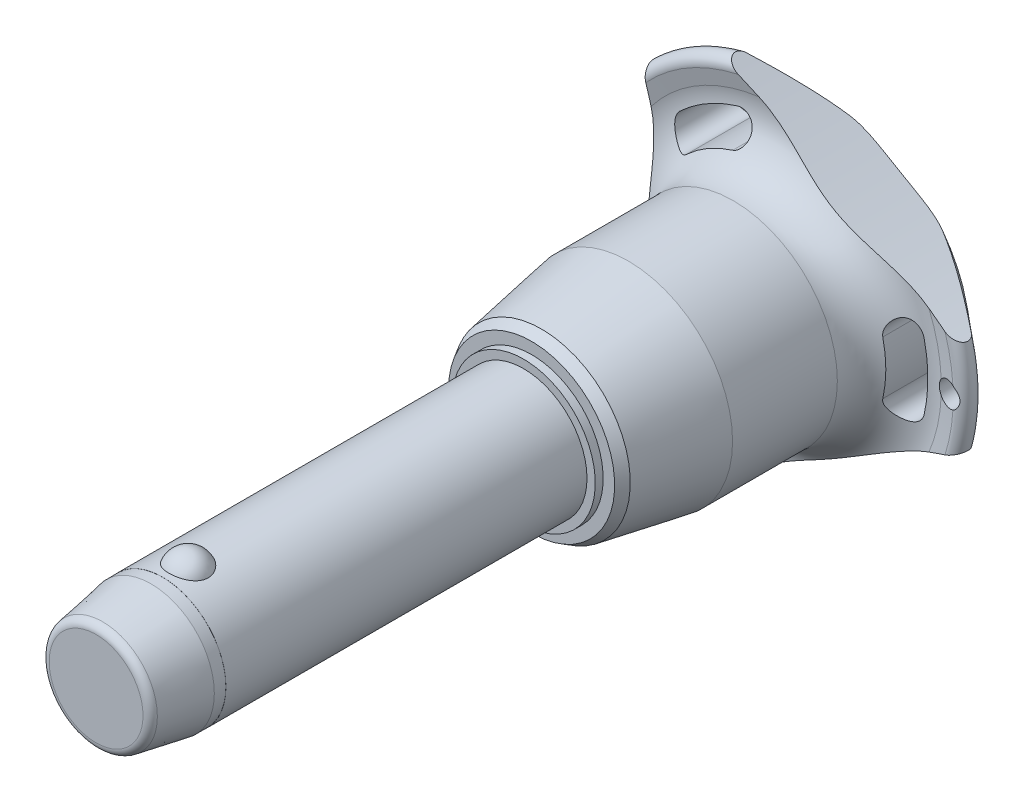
from build123d import *

# Parameters (mm, degrees)
SKETCH1_R           = 8
BOSS_EXTRUDE1_DEPTH = 40
SKETCH2_R           = 7
BOSS_EXTRUDE2_DEPTH = 39.7
BOSS_EXTRUDE3_START = 14
SKETCH1_2_R         = 8
BOSS_EXTRUDE3_DEPTH = 14
CHAMFER1_SIZE       = 7
CHAMFER1_SIZE2      = 1.234288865
FILLET1_R           = 1
SKETCH6_R           = 144.275
CUT_EXTRUDE1_DEPTH  = 87.518467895
CIRPATTERN1_COUNT   = 3
SKETCH7_R           = 1.5
CUT_EXTRUDE2_DEPTH  = 87.286194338
SKETCH8_R           = 8
SKETCH8_R_2         = 7.99
CUT_EXTRUDE3_DEPTH  = 8.4


with BuildPart() as part:
    # Sketch1 → Boss-Extrude1 (new body)
    with BuildSketch(Plane.XY):
        Circle(SKETCH1_R)
    extrude(amount=-BOSS_EXTRUDE1_DEPTH)

    # Sketch2 → Boss-Extrude2 (add)
    with BuildSketch(Plane(origin=(0, 0, -40), x_dir=(-1, 0, 0), z_dir=(0, 0, -1))):
        Circle(SKETCH2_R)
    extrude(amount=BOSS_EXTRUDE2_DEPTH)

    # Sketch3 → Revolve1 (revolve)
    with BuildSketch(Plane(origin=(0, 0, 0), x_dir=(0, 0, -1), z_dir=(1, 0, 0))):
        with BuildLine():
            Line((-2.387467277, 9.5), (-2.387467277, 4.2))
            ThreePointArc((-2.387467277, 4.2), (0.262532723, 6.85), (-2.387467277, 9.5))
        make_face()
        with BuildLine():
            Line((-2.387467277, -4.2), (-2.387467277, -9.5))
            ThreePointArc((-2.387467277, -9.5), (0.262532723, -6.85), (-2.387467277, -4.2))
        make_face()
    revolve(axis=Axis((0, -4.2, 2.387467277), (0, 1, 0)))

    # Sketch1_2 → Boss-Extrude3 (add)
    with BuildSketch(Plane.XY.offset(BOSS_EXTRUDE3_START)):
        Circle(SKETCH1_2_R)
    extrude(amount=-BOSS_EXTRUDE3_DEPTH)

    # Chamfer1
    chamfer1_edges = [part.edges().sort_by_distance(p)[0] for p in [
        (-8, 0, 14),
    ]]
    chamfer1_side = [part.faces().sort_by_distance(p)[0] for p in [
        (-8, 0, -13),
    ]]
    chamfer(chamfer1_edges, length=CHAMFER1_SIZE, length2=CHAMFER1_SIZE2, reference=chamfer1_side[0])

    # Fillet1
    fillet1_edges = [part.edges().sort_by_distance(p)[0] for p in [
        (-6.765711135, 0, 14),
        (7, 0, -79.7),
    ]]
    fillet(fillet1_edges, radius=FILLET1_R)

    # Sketch4 → Revolve2 (revolve)
    with BuildSketch(Plane(origin=(0, 0, 0), x_dir=(0, 0, -1), z_dir=(1, 0, 0)), mode=Mode.PRIVATE) as revolve2_sk:
        Polygon((40, 0), (40, 9.044607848), (41, 9.044607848), (41, 10.490707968), (42.25235944, 11.213758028), (53.233333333, 13.15), (66.466666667, 13.15), (66.466666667, 0), align=None)
    revolve(revolve2_sk.sketch.rotate(Axis((0, 0, -66.466666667), (0, 0, 1)), 90), axis=Axis((0, 0, -66.466666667), (0, 0, 1)))

    # Sketch5 → Revolve3 (revolve)
    with BuildSketch(Plane(origin=(0, 0, 0), x_dir=(0, 0, -1), z_dir=(1, 0, 0)), mode=Mode.PRIVATE) as revolve3_sk:
        with BuildLine():
            Line((72.32877039, 20.428960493), (71.910912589, 22.344207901))
            ThreePointArc((71.910912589, 22.344207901), (72.554394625, 23.677136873), (74.002586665, 23.371345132))
            Line((74.002586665, 23.371345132), (79.141488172, 17.247040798))
            ThreePointArc((79.141488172, 17.247040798), (79.7, 15.584758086), (78.978803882, 13.986322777))
            ThreePointArc((78.978803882, 13.986322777), (74.617427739, 7.589034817), (73.083333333, 0))
            Line((73.083333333, 0), (66.466666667, 0))
            Line((66.466666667, 0), (66.466666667, 13.15))
            ThreePointArc((66.466666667, 13.15), (71.139661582, 15.38660811), (72.32877039, 20.428960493))
        make_face()
    revolve(revolve3_sk.sketch.rotate(Axis((0, 0, -73.083333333), (0, 0, 1)), 90), axis=Axis((0, 0, -73.083333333), (0, 0, 1)))

    # Sketch6 → Cut-Extrude1 (cut, through all)
    with BuildSketch(Plane.XY):
        with Locations((-159.975, 0)):
            Circle(SKETCH6_R)
        with BuildLine():
            ThreePointArc((18.131206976, -4.190753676), (18.60922037, 0), (18.131206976, 4.190753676))
            ThreePointArc((18.131206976, 4.190753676), (15.94840906, 5.553949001), (14.585213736, 3.371151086))
            ThreePointArc((14.585213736, 3.371151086), (14.969740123, 0), (14.585213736, -3.371151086))
            ThreePointArc((14.585213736, -3.371151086), (15.94840906, -5.553949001), (18.131206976, -4.190753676))
        make_face()
    cut_extrude1 = extrude(amount=-CUT_EXTRUDE1_DEPTH, mode=Mode.SUBTRACT)

    # CirPattern1: Cut-Extrude1 ×3 about axis
    cirpattern1_axis = Axis((0, 0, 0), (0, 0, 1))
    for i in range(1, CIRPATTERN1_COUNT):
        add(cut_extrude1.rotate(cirpattern1_axis, i * 360 / CIRPATTERN1_COUNT), mode=Mode.SUBTRACT)

    # Sketch7 → Cut-Extrude2 (cut, through all)
    with BuildSketch(Plane.XY):
        with Locations(Location((21.60922037, 0, 0), (0, 0, 297.620773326))):
            Circle(SKETCH7_R)
    extrude(amount=-CUT_EXTRUDE2_DEPTH, mode=Mode.SUBTRACT)

    # Sketch8 → Cut-Extrude3 (cut)
    with BuildSketch(Plane.XY.offset(14)):
        Circle(SKETCH8_R)
        Circle(SKETCH8_R_2, mode=Mode.SUBTRACT)
    extrude(amount=-CUT_EXTRUDE3_DEPTH, mode=Mode.SUBTRACT)


solid = part.part
